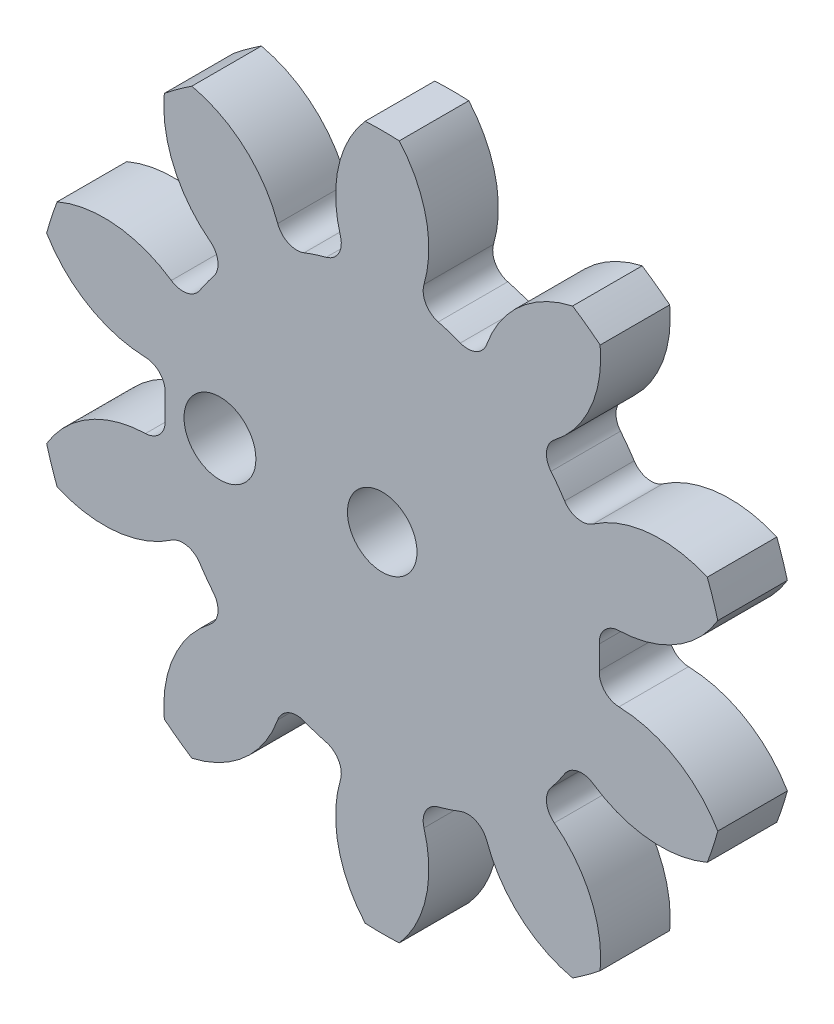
from build123d import *

# Parameters (mm, degrees)
BOSS_EXTRU_1_DEPTH                 = 6
CONG_1_R                           = 1.75
R_P_TITION_CIRCULAIRE4_COUNT       = 10
CONG_1_OF_R_P_TITION_CIRCULAIRE4_R = 1.75
ESQUISSE6_R                        = 3
ENL_V_MAT_EXTRU_1_DEPTH            = 10
ESQUISSE8_R                        = 3.1
ENL_V_MAT_EXTRU_3_DEPTH            = 43.121013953


with BuildPart() as part:
    # Esquisse3 → Boss.-Extru.1 (new body)
    with BuildSketch(Plane.XY):
        with BuildLine():
            Line((-5.794068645, 17.832309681), (0, 0))
            Line((0, 0), (5.794068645, 17.832309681))
            ThreePointArc((5.794068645, 17.832309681), (4.357814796, 18.236555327), (2.893965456, 18.525319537))
            ThreePointArc((2.893965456, 18.525319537), (3.941898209, 24.464041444), (1.468694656, 29.964027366))
            ThreePointArc((1.468694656, 29.964027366), (0, 30), (-1.468694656, 29.964027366))
            ThreePointArc((-1.468694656, 29.964027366), (-3.941898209, 24.464041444), (-2.893965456, 18.525319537))
            ThreePointArc((-2.893965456, 18.525319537), (-4.357814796, 18.236555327), (-5.794068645, 17.832309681))
        make_face()
    boss_extru_1 = extrude(amount=BOSS_EXTRU_1_DEPTH)

    # Cong_1
    cong_1_edges = [part.edges().sort_by_distance(p)[0] for p in [
        (-2.893965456, 18.525319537, 3),
        (2.893965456, 18.525319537, 3),
    ]]
    fillet(cong_1_edges, radius=CONG_1_R)

    # R_p_tition circulaire4: Boss.-Extru.1 ×10 about axis
    r_p_tition_circulaire4_axis = Axis((0, 0, 0), (0, 0, 1))
    for i in range(1, R_P_TITION_CIRCULAIRE4_COUNT):
        add(boss_extru_1.rotate(r_p_tition_circulaire4_axis, i * 360 / R_P_TITION_CIRCULAIRE4_COUNT))

    # Cong_1 of R_p_tition circulaire4
    cong_1_of_r_p_tition_circulaire4_edges = [part.edges().sort_by_distance(p)[0] for p in [
        (-13.230176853, 13.286268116, 3),
        (-8.547642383, 16.688328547, 3),
        (-18.512910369, 2.972313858, 3),
        (-16.724341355, 8.476963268, 3),
        (-16.724341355, -8.476963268, 3),
        (-18.512910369, -2.972313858, 3),
        (-8.547642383, -16.688328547, 3),
        (-13.230176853, -13.286268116, 3),
        (2.893965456, -18.525319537, 3),
        (-2.893965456, -18.525319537, 3),
        (13.230176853, -13.286268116, 3),
        (8.547642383, -16.688328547, 3),
        (18.512910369, -2.972313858, 3),
        (16.724341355, -8.476963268, 3),
        (16.724341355, 8.476963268, 3),
        (18.512910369, 2.972313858, 3),
        (8.547642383, 16.688328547, 3),
        (13.230176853, 13.286268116, 3),
    ]]
    fillet(cong_1_of_r_p_tition_circulaire4_edges, radius=CONG_1_OF_R_P_TITION_CIRCULAIRE4_R)

    # Esquisse6 → Enl_v. mat.-Extru.1 (cut)
    with BuildSketch(Plane.XY.offset(6)):
        Circle(ESQUISSE6_R)
    extrude(amount=-ENL_V_MAT_EXTRU_1_DEPTH, mode=Mode.SUBTRACT)

    # Esquisse8 → Enl_v. mat.-Extru.3 (cut, through all)
    with BuildSketch(Plane.XY.offset(6)):
        with Locations((-14, 0)):
            Circle(ESQUISSE8_R)
    extrude(amount=-ENL_V_MAT_EXTRU_3_DEPTH, mode=Mode.SUBTRACT)


solid = part.part
